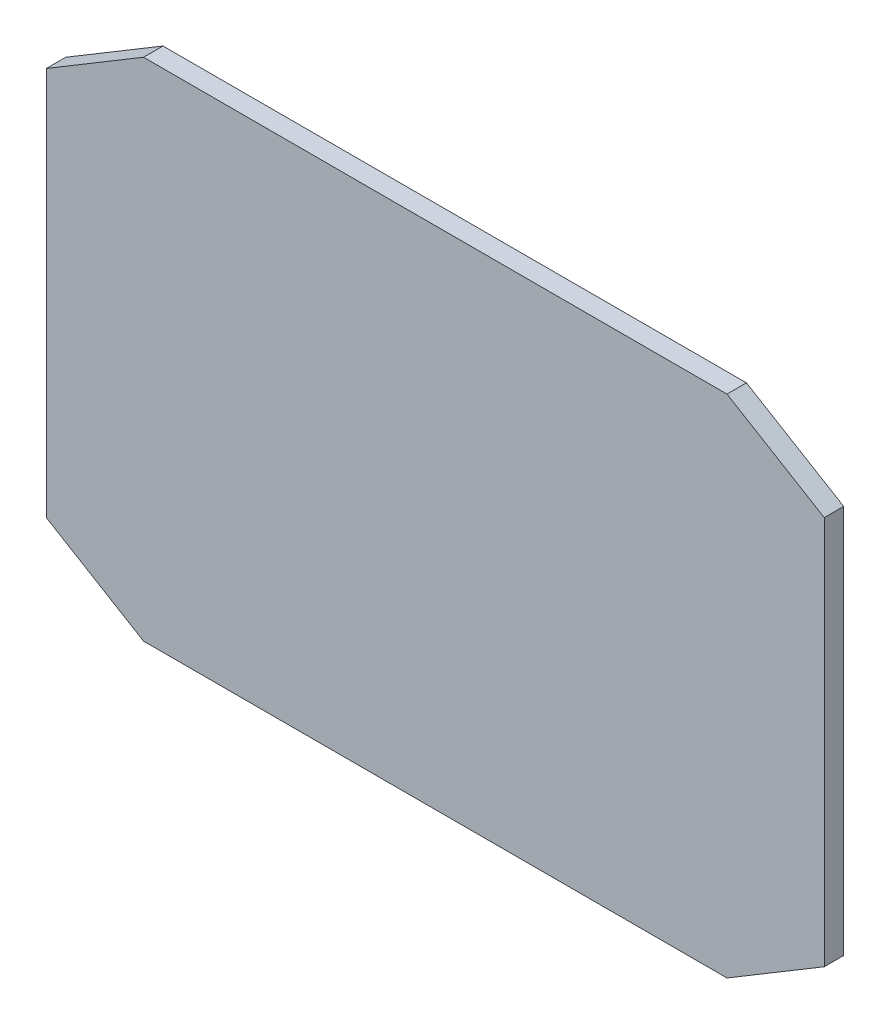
from build123d import *
from OCP.BRepFilletAPI import BRepFilletAPI_MakeChamfer

# Parameters (mm, degrees)
ESQUISSE1_W      = 400
ESQUISSE1_H      = 260
EXTRUSION1_DEPTH = 10
CHANFREIN1_SIZE  = 50
CHANFREIN1_SIZE2 = 30
CHANFREIN2_SIZE  = 30
CHANFREIN2_SIZE2 = 50


with BuildPart() as part:
    # Esquisse1 → Extrusion1 (new body)
    with BuildSketch(Plane.XY):
        with Locations((200, 130)):
            Rectangle(ESQUISSE1_W, ESQUISSE1_H)
    extrude(amount=EXTRUSION1_DEPTH)

    # Chanfrein1: one chamfer whose edges measure the first distance from different faces: ONE call of the kernel's chamfer builder (chamfer() names one face for all edges)
    chanfrein1_edges_1 = [part.edges().sort_by_distance(p)[0] for p in [
        (0, 260, 5),
    ]]
    chanfrein1_side_1 = [part.faces().sort_by_distance(p)[0] for p in [
        (200, 260, 5),
    ]]
    chanfrein1_edges_2 = [part.edges().sort_by_distance(p)[0] for p in [
        (400, 0, 5),
    ]]
    chanfrein1_side_2 = [part.faces().sort_by_distance(p)[0] for p in [
        (200, 0, 5),
    ]]
    chanfrein1 = BRepFilletAPI_MakeChamfer(part.part.solid().wrapped)
    for e in chanfrein1_edges_1:
        chanfrein1.Add(CHANFREIN1_SIZE, CHANFREIN1_SIZE2, e.wrapped, chanfrein1_side_1[0].wrapped)  # the first distance lies on this face
    for e in chanfrein1_edges_2:
        chanfrein1.Add(CHANFREIN1_SIZE, CHANFREIN1_SIZE2, e.wrapped, chanfrein1_side_2[0].wrapped)  # the first distance lies on this face
    add(Compound.cast(chanfrein1.Shape()), mode=Mode.REPLACE)

    # Chanfrein2: one chamfer whose edges measure the first distance from different faces: ONE call of the kernel's chamfer builder (chamfer() names one face for all edges)
    chanfrein2_edges_1 = [part.edges().sort_by_distance(p)[0] for p in [
        (400, 260, 5),
    ]]
    chanfrein2_side_1 = [part.faces().sort_by_distance(p)[0] for p in [
        (400, 145, 5),
    ]]
    chanfrein2_edges_2 = [part.edges().sort_by_distance(p)[0] for p in [
        (0, 0, 5),
    ]]
    chanfrein2_side_2 = [part.faces().sort_by_distance(p)[0] for p in [
        (0, 115, 5),
    ]]
    chanfrein2 = BRepFilletAPI_MakeChamfer(part.part.solid().wrapped)
    for e in chanfrein2_edges_1:
        chanfrein2.Add(CHANFREIN2_SIZE, CHANFREIN2_SIZE2, e.wrapped, chanfrein2_side_1[0].wrapped)  # the first distance lies on this face
    for e in chanfrein2_edges_2:
        chanfrein2.Add(CHANFREIN2_SIZE, CHANFREIN2_SIZE2, e.wrapped, chanfrein2_side_2[0].wrapped)  # the first distance lies on this face
    add(Compound.cast(chanfrein2.Shape()), mode=Mode.REPLACE)


solid = part.part
